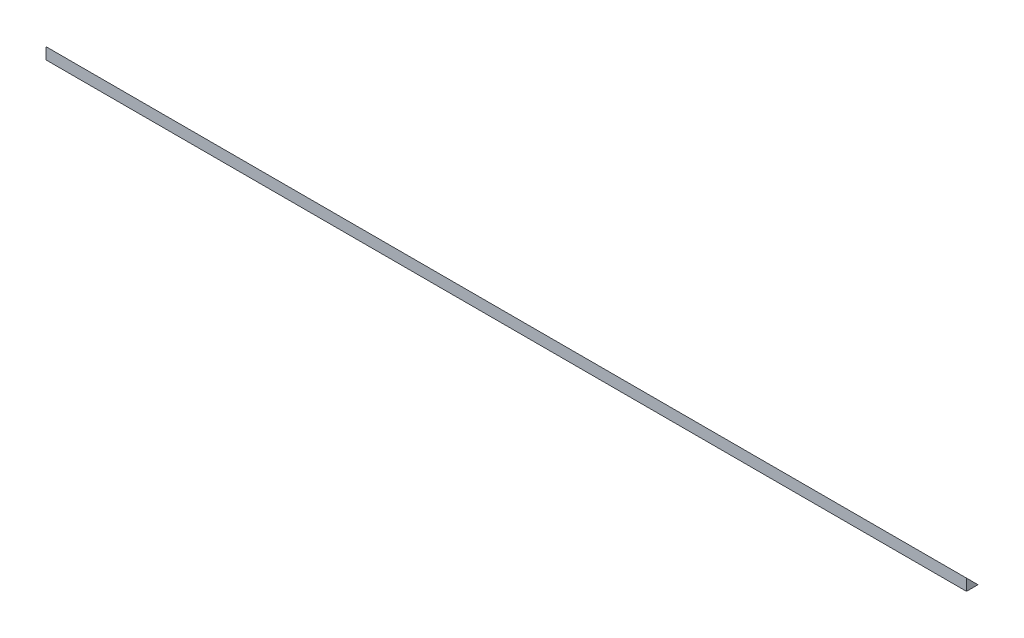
ISO-10303-21;
HEADER;
FILE_DESCRIPTION(('STEP AP214'),'2;1');
FILE_NAME('part.step','',(''),(''),'','','');
FILE_SCHEMA(('AUTOMOTIVE_DESIGN { 1 0 10303 214 1 1 1 1 }'));
ENDSEC;
DATA;
#1=APPLICATION_CONTEXT('core data for automotive mechanical design processes');
#2=APPLICATION_PROTOCOL_DEFINITION('international standard','automotive_design',2000,#1);
#3=PRODUCT_CONTEXT('',#1,'mechanical');
#4=PRODUCT('Part','Part','',(#3));
#5=PRODUCT_RELATED_PRODUCT_CATEGORY('part','',(#4));
#6=PRODUCT_DEFINITION_FORMATION('','',#4);
#7=PRODUCT_DEFINITION_CONTEXT('part definition',#1,'design');
#8=PRODUCT_DEFINITION('design','',#6,#7);
#9=PRODUCT_DEFINITION_SHAPE('','',#8);
#10=(LENGTH_UNIT() NAMED_UNIT(*) SI_UNIT(.MILLI.,.METRE.));
#11=(NAMED_UNIT(*) PLANE_ANGLE_UNIT() SI_UNIT($,.RADIAN.));
#12=(NAMED_UNIT(*) SI_UNIT($,.STERADIAN.) SOLID_ANGLE_UNIT());
#13=UNCERTAINTY_MEASURE_WITH_UNIT(LENGTH_MEASURE(1.E-05),#10,'distance_accuracy_value','');
#14=(GEOMETRIC_REPRESENTATION_CONTEXT(3) GLOBAL_UNCERTAINTY_ASSIGNED_CONTEXT((#13)) GLOBAL_UNIT_ASSIGNED_CONTEXT((#10,
#11,#12)) REPRESENTATION_CONTEXT('',''));
#15=CARTESIAN_POINT('',(0.,0.,0.));
#16=DIRECTION('',(0.,0.,1.));
#17=DIRECTION('',(1.,0.,0.));
#18=AXIS2_PLACEMENT_3D('',#15,#16,#17);
#19=CARTESIAN_POINT('',(199.741094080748,180.000000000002,0.));
#20=DIRECTION('',(0.,-1.,0.));
#21=DIRECTION('',(1.,0.,0.));
#22=AXIS2_PLACEMENT_3D('',#19,#20,#21);
#23=PLANE('',#22);
#24=DIRECTION('',(0.,0.,-1.));
#25=VECTOR('',#24,1.);
#26=CARTESIAN_POINT('',(199.741094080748,180.000000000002,0.));
#27=LINE('',#26,#25);
#28=CARTESIAN_POINT('',(199.741094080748,180.000000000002,0.));
#29=VERTEX_POINT('',#28);
#30=CARTESIAN_POINT('',(199.741094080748,180.000000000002,-4.99999999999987));
#31=VERTEX_POINT('',#30);
#32=EDGE_CURVE('E74',#29,#31,#27,.T.);
#33=ORIENTED_EDGE('',*,*,#32,.F.);
#34=DIRECTION('',(-1.,0.,0.));
#35=VECTOR('',#34,1.);
#36=CARTESIAN_POINT('',(199.741094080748,180.000000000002,0.));
#37=LINE('',#36,#35);
#38=CARTESIAN_POINT('',(-200.258905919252,180.000000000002,0.));
#39=VERTEX_POINT('',#38);
#40=EDGE_CURVE('E66',#29,#39,#37,.T.);
#41=ORIENTED_EDGE('',*,*,#40,.T.);
#42=DIRECTION('',(0.,0.,-1.));
#43=VECTOR('',#42,1.);
#44=CARTESIAN_POINT('',(-200.258905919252,180.000000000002,0.));
#45=LINE('',#44,#43);
#46=CARTESIAN_POINT('',(-200.258905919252,180.000000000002,-4.99999999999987));
#47=VERTEX_POINT('',#46);
#48=EDGE_CURVE('E81',#39,#47,#45,.T.);
#49=ORIENTED_EDGE('',*,*,#48,.T.);
#50=DIRECTION('',(1.,0.,0.));
#51=VECTOR('',#50,1.);
#52=CARTESIAN_POINT('',(199.741094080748,180.000000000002,-4.99999999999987));
#53=LINE('',#52,#51);
#54=EDGE_CURVE('E35',#47,#31,#53,.T.);
#55=ORIENTED_EDGE('',*,*,#54,.T.);
#56=EDGE_LOOP('',(#33,#41,#49,#55));
#57=FACE_BOUND('',#56,.T.);
#58=ADVANCED_FACE('F31',(#57),#23,.T.);
#59=CARTESIAN_POINT('',(199.741094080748,180.000000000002,1.31208175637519E-13));
#60=DIRECTION('',(1.,0.,0.));
#61=DIRECTION('',(0.,1.,0.));
#62=AXIS2_PLACEMENT_3D('',#59,#60,#61);
#63=PLANE('',#62);
#64=ORIENTED_EDGE('',*,*,#32,.T.);
#65=DIRECTION('',(0.,-0.707106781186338,-0.707106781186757));
#66=VECTOR('',#65,1.);
#67=CARTESIAN_POINT('',(199.741094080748,184.999999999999,1.31838984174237E-13));
#68=LINE('',#67,#66);
#69=CARTESIAN_POINT('',(199.741094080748,184.999999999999,1.31838984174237E-13));
#70=VERTEX_POINT('',#69);
#71=EDGE_CURVE('E80',#70,#31,#68,.T.);
#72=ORIENTED_EDGE('',*,*,#71,.F.);
#73=DIRECTION('',(0.,1.,0.));
#74=VECTOR('',#73,1.);
#75=CARTESIAN_POINT('',(199.741094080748,180.000000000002,1.31208175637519E-13));
#76=LINE('',#75,#74);
#77=EDGE_CURVE('E71',#29,#70,#76,.T.);
#78=ORIENTED_EDGE('',*,*,#77,.F.);
#79=EDGE_LOOP('',(#64,#72,#78));
#80=FACE_BOUND('',#79,.T.);
#81=ADVANCED_FACE('F79',(#80),#63,.T.);
#82=CARTESIAN_POINT('',(865.,129.999999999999,1.2490009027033E-13));
#83=DIRECTION('',(0.,0.,1.));
#84=DIRECTION('',(0.,-1.,0.));
#85=AXIS2_PLACEMENT_3D('',#82,#83,#84);
#86=PLANE('',#85);
#87=DIRECTION('',(0.,-1.,0.));
#88=VECTOR('',#87,1.);
#89=CARTESIAN_POINT('',(-200.258905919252,180.000000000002,0.));
#90=LINE('',#89,#88);
#91=CARTESIAN_POINT('',(-200.258905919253,184.999999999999,1.31838984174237E-13));
#92=VERTEX_POINT('',#91);
#93=EDGE_CURVE('E53',#92,#39,#90,.T.);
#94=ORIENTED_EDGE('',*,*,#93,.T.);
#95=ORIENTED_EDGE('',*,*,#40,.F.);
#96=ORIENTED_EDGE('',*,*,#77,.T.);
#97=DIRECTION('',(-1.,0.,0.));
#98=VECTOR('',#97,1.);
#99=CARTESIAN_POINT('',(865.,184.999999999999,1.31838984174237E-13));
#100=LINE('',#99,#98);
#101=EDGE_CURVE('E40',#70,#92,#100,.T.);
#102=ORIENTED_EDGE('',*,*,#101,.T.);
#103=EDGE_LOOP('',(#94,#95,#96,#102));
#104=FACE_BOUND('',#103,.T.);
#105=ADVANCED_FACE('F68',(#104),#86,.T.);
#106=CARTESIAN_POINT('',(-200.258905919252,180.000000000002,0.));
#107=DIRECTION('',(-1.,0.,0.));
#108=DIRECTION('',(0.,-1.,0.));
#109=AXIS2_PLACEMENT_3D('',#106,#107,#108);
#110=PLANE('',#109);
#111=ORIENTED_EDGE('',*,*,#48,.F.);
#112=ORIENTED_EDGE('',*,*,#93,.F.);
#113=DIRECTION('',(0.,-0.707106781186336,-0.707106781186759));
#114=VECTOR('',#113,1.);
#115=CARTESIAN_POINT('',(-200.258905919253,184.999999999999,1.31838984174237E-13));
#116=LINE('',#115,#114);
#117=EDGE_CURVE('E11',#92,#47,#116,.T.);
#118=ORIENTED_EDGE('',*,*,#117,.T.);
#119=EDGE_LOOP('',(#111,#112,#118));
#120=FACE_BOUND('',#119,.T.);
#121=ADVANCED_FACE('F87',(#120),#110,.T.);
#122=CARTESIAN_POINT('',(199.741094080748,180.000000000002,-4.99999999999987));
#123=DIRECTION('',(0.,0.707106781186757,-0.707106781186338));
#124=DIRECTION('',(0.,0.707106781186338,0.707106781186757));
#125=AXIS2_PLACEMENT_3D('',#122,#123,#124);
#126=PLANE('',#125);
#127=ORIENTED_EDGE('',*,*,#54,.F.);
#128=ORIENTED_EDGE('',*,*,#117,.F.);
#129=ORIENTED_EDGE('',*,*,#101,.F.);
#130=ORIENTED_EDGE('',*,*,#71,.T.);
#131=EDGE_LOOP('',(#127,#128,#129,#130));
#132=FACE_BOUND('',#131,.T.);
#133=ADVANCED_FACE('F33',(#132),#126,.T.);
#134=CLOSED_SHELL('',(#58,#81,#105,#121,#133));
#135=MANIFOLD_SOLID_BREP('B2',#134);
#136=ADVANCED_BREP_SHAPE_REPRESENTATION('',(#18,#135),#14);
#137=SHAPE_DEFINITION_REPRESENTATION(#9,#136);
ENDSEC;
END-ISO-10303-21;
